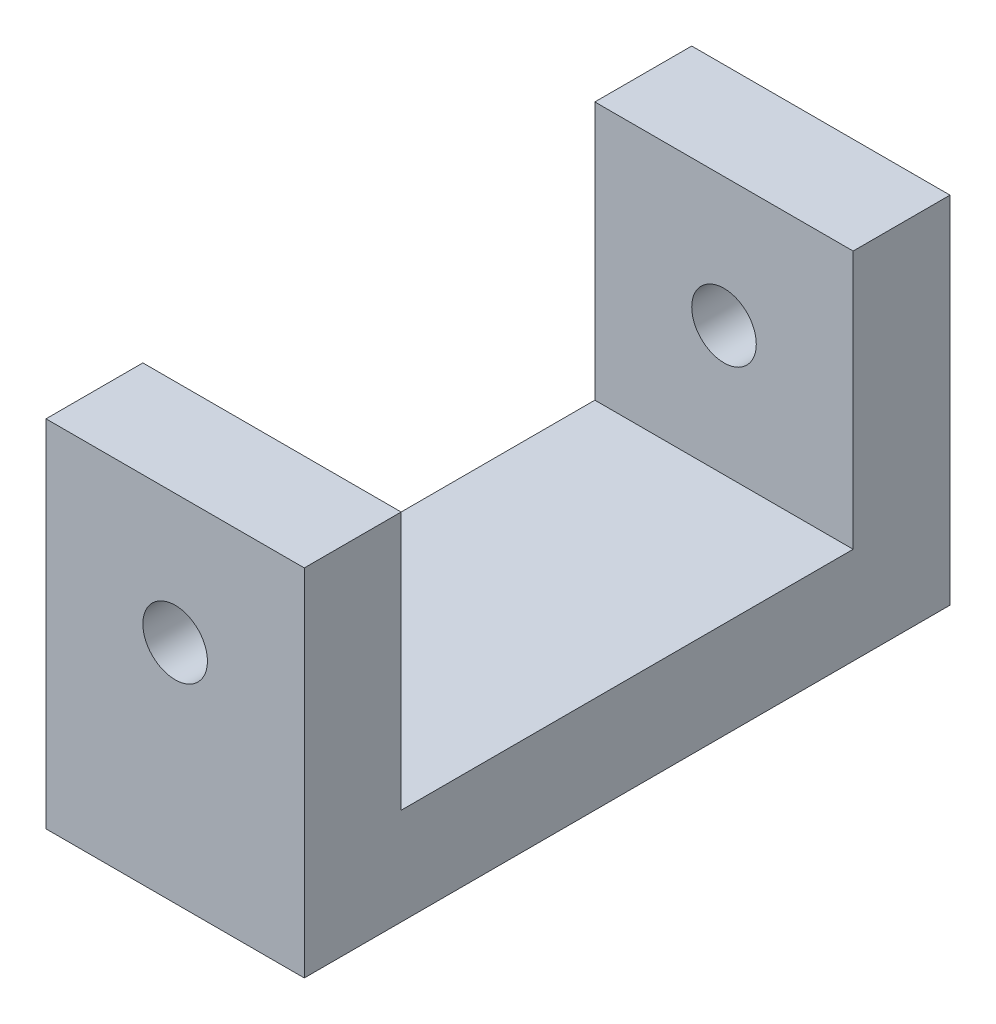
from build123d import *

# Parameters (mm, degrees)
SKETCH1_W           = 40
SKETCH1_H           = 45
BOSS_EXTRUDE1_DEPTH = 100
SKETCH2_W           = 70
SKETCH2_H           = 30
CUT_EXTRUDE1_DEPTH  = 40
SKETCH5_W           = 70
SKETCH5_H           = 5
CUT_EXTRUDE4_DEPTH  = 40
SKETCH6_R           = 5
CUT_EXTRUDE5_DEPTH  = 100
SKETCH7_W           = 40
SKETCH7_H           = 15
BOSS_EXTRUDE2_DEPTH = 10
SKETCH8_W           = 40
SKETCH8_H           = 15
BOSS_EXTRUDE3_DEPTH = 10
SKETCH9_W           = 40
SKETCH9_H           = 70
BOSS_EXTRUDE4_DEPTH = 5


with BuildPart() as part:
    # Sketch1 → Boss-Extrude1 (new body)
    with BuildSketch(Plane.XY):
        with Locations((20, 22.5)):
            Rectangle(SKETCH1_W, SKETCH1_H)
    extrude(amount=-BOSS_EXTRUDE1_DEPTH)

    # Sketch2 → Cut-Extrude1 (cut)
    with BuildSketch(Plane(origin=(40, 0, 0), x_dir=(0, 0, -1), z_dir=(1, 0, 0))):
        with Locations((50, 30)):
            Rectangle(SKETCH2_W, SKETCH2_H)
    extrude(amount=-CUT_EXTRUDE1_DEPTH, mode=Mode.SUBTRACT)

    # Sketch5 → Cut-Extrude4 (cut)
    with BuildSketch(Plane(origin=(40, 0, 0), x_dir=(0, 0, -1), z_dir=(1, 0, 0))):
        with Locations((50, 12.5)):
            Rectangle(SKETCH5_W, SKETCH5_H)
    extrude(amount=-CUT_EXTRUDE4_DEPTH, mode=Mode.SUBTRACT)

    # Sketch6 → Cut-Extrude5 (cut)
    with BuildSketch(Plane.XY):
        with Locations((20, 35)):
            Circle(SKETCH6_R)
    extrude(amount=-CUT_EXTRUDE5_DEPTH, mode=Mode.SUBTRACT)

    # Sketch7 → Boss-Extrude2 (add)
    with BuildSketch(Plane(origin=(0, 45, 0), x_dir=(1, 0, 0), z_dir=(0, 1, 0))):
        with Locations((20, 7.5)):
            Rectangle(SKETCH7_W, SKETCH7_H)
    extrude(amount=BOSS_EXTRUDE2_DEPTH)

    # Sketch8 → Boss-Extrude3 (add)
    with BuildSketch(Plane(origin=(0, 45, 0), x_dir=(1, 0, 0), z_dir=(0, 1, 0))):
        with Locations((20, 92.5)):
            Rectangle(SKETCH8_W, SKETCH8_H)
    extrude(amount=BOSS_EXTRUDE3_DEPTH)

    # Sketch9 → Boss-Extrude4 (add)
    with BuildSketch(Plane(origin=(0, 10, 0), x_dir=(1, 0, 0), z_dir=(0, 1, 0))):
        with Locations((20, 50)):
            Rectangle(SKETCH9_W, SKETCH9_H)
    extrude(amount=BOSS_EXTRUDE4_DEPTH)


solid = part.part
